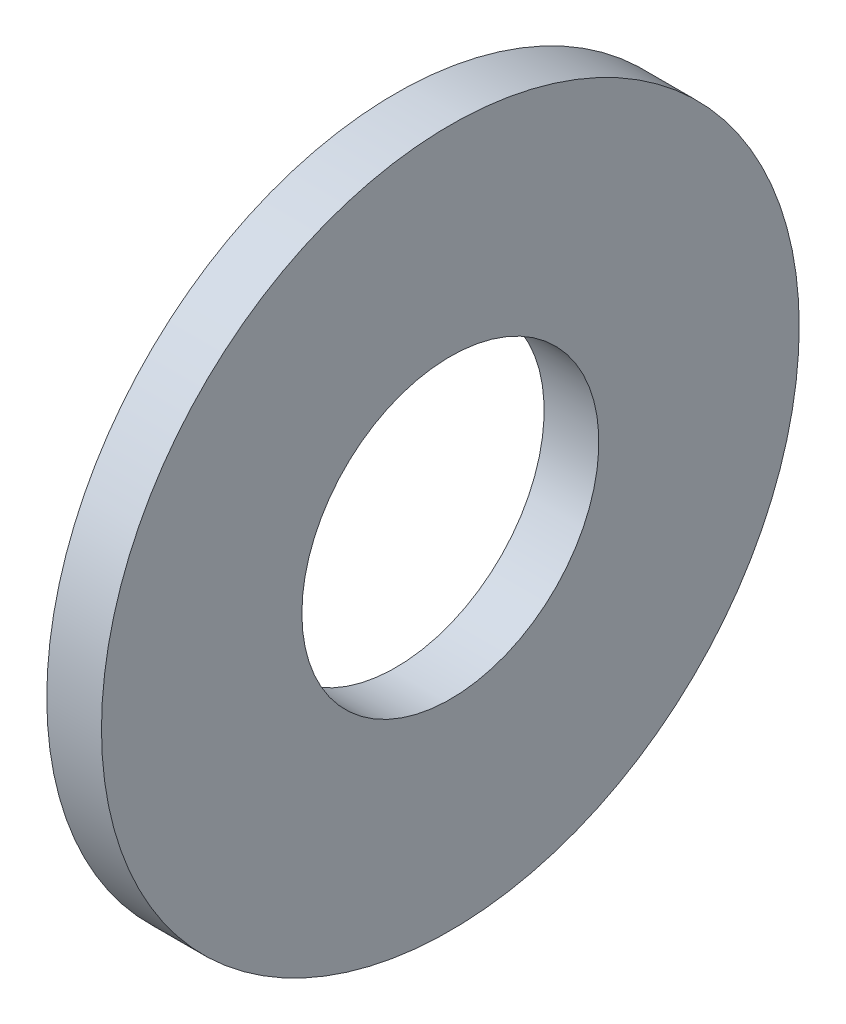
from build123d import *

# Parameters (mm, degrees)
SKETCH1_W = 1.2446
SKETCH1_H = 4.5593


with BuildPart() as part:
    # Sketch1 → Base-Revolve (revolve)
    with BuildSketch(Plane.XY, mode=Mode.PRIVATE) as base_revolve_sk:
        with Locations((-0.6223, 5.65785)):
            Rectangle(SKETCH1_W, SKETCH1_H)
    revolve(base_revolve_sk.sketch.rotate(Axis((-34.925, 0, 0), (1, 0, 0)), 90), axis=Axis((-34.925, 0, 0), (1, 0, 0)))


solid = part.part
